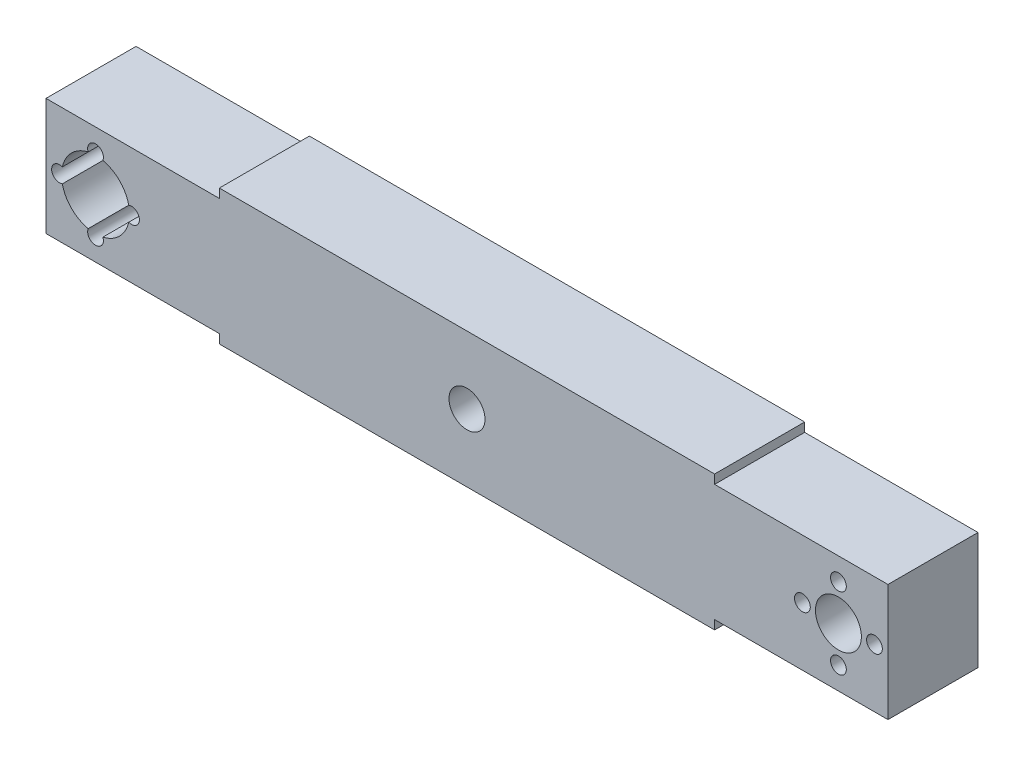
from build123d import *

# Parameters (mm, degrees)
CROQUIS1_W              = 110
CROQUIS1_H              = 30
SALIENTE_EXTRUIR1_DEPTH = 20
CROQUIS3_W              = 189
CROQUIS3_H              = 28
SALIENTE_EXTRUIR3_DEPTH = 20
CROQUIS4_R              = 5.1
CROQUIS4_R_2            = 1.75
CORTAR_EXTRUIR1_DEPTH   = 20
CUT_EXTRUDE1_REACH      = 99.751
CUT_EXTRUDE2_REACH      = 98.785
SKETCH2_R               = 4
CUT_EXTRUDE3_REACH      = 98.785
SKETCH6_R               = 3
CUT_EXTRUDE4_REACH      = 101.164
SKETCH7_R               = 7.55


with BuildPart() as part:
    # Croquis1 → Saliente-Extruir1 (new body)
    with BuildSketch(Plane.XY):
        Rectangle(CROQUIS1_W, CROQUIS1_H)
    extrude(amount=SALIENTE_EXTRUIR1_DEPTH)

    # Croquis3 → Saliente-Extruir3 (add)
    with BuildSketch(Plane(origin=(0, 0, 0), x_dir=(-1, 0, 0), z_dir=(0, 0, -1))):
        Rectangle(CROQUIS3_W, CROQUIS3_H)
    extrude(amount=-SALIENTE_EXTRUIR3_DEPTH)

    # Croquis4 → Cortar-Extruir1 (cut)
    with BuildSketch(Plane(origin=(0, 0, 0), x_dir=(-1, 0, 0), z_dir=(0, 0, -1))):
        with Locations((-82.5, 0)):
            Circle(CROQUIS4_R)
        with Locations((-90.5, 0)):
            Circle(CROQUIS4_R_2)
        with Locations((-82.5, 8)):
            Circle(CROQUIS4_R_2)
        with Locations((-74.5, 0)):
            Circle(CROQUIS4_R_2)
        with Locations((-82.5, -8)):
            Circle(CROQUIS4_R_2)
        with Locations(Location((82.5, -8, 0), (0, 0, 180))):
            Circle(CROQUIS4_R_2)
        with Locations(Location((74.5, 0, 0), (0, 0, 180))):
            Circle(CROQUIS4_R_2)
        with Locations(Location((90.5, 0, 0), (0, 0, 180))):
            Circle(CROQUIS4_R_2)
        with Locations(Location((82.5, 8, 0), (0, 0, 180))):
            Circle(CROQUIS4_R_2)
        with Locations(Location((82.5, 0, 0), (0, 0, 180))):
            Circle(CROQUIS4_R)
    extrude(amount=-CORTAR_EXTRUIR1_DEPTH, mode=Mode.SUBTRACT)

    # Sketch1 → Cut-Extrude1 (cut, up to next)
    with BuildSketch(Plane(origin=(0, 0, 0), x_dir=(-1, 0, 0), z_dir=(0, 0, -1)), mode=Mode.PRIVATE) as cut_extrude1_sk1:
        Polygon((-56, 13), (-93.5, 13), (-93.5, -13), (-56, -13), (-55, -13), (-55, -14), (-94.5, -14), (-94.5, 14), (-55, 14), (-55, 13), align=None)
    cut_extrude1_tool1 = extrude(cut_extrude1_sk1.sketch, amount=-CUT_EXTRUDE1_REACH, mode=Mode.PRIVATE) & part.part
    # Sketch1 → Cut-Extrude1 (cut, up to next)
    with BuildSketch(Plane(origin=(0, 0, 0), x_dir=(-1, 0, 0), z_dir=(0, 0, -1)), mode=Mode.PRIVATE) as cut_extrude1_sk2:
        Polygon((55, -13), (55, -14), (94.5, -14), (94.5, 14), (55, 14), (55, 13), (56, 13), (93.5, 13), (93.5, -13), (56, -13), align=None)
    cut_extrude1_tool2 = extrude(cut_extrude1_sk2.sketch, amount=-CUT_EXTRUDE1_REACH, mode=Mode.PRIVATE) & part.part
    add(cut_extrude1_tool1.solids().sort_by_distance((74.75, 13.484175, 0))[0], mode=Mode.SUBTRACT)
    add(cut_extrude1_tool2.solids().sort_by_distance((-55.484175, -13.5, 0))[0], mode=Mode.SUBTRACT)

    # Sketch2 → Cut-Extrude2 (cut, up to next)
    with BuildSketch(Plane(origin=(0, 0, 0), x_dir=(-1, 0, 0), z_dir=(0, 0, -1)), mode=Mode.PRIVATE) as cut_extrude2_sk1:
        Circle(SKETCH2_R)
    cut_extrude2_tool1 = extrude(cut_extrude2_sk1.sketch, amount=-CUT_EXTRUDE2_REACH, mode=Mode.PRIVATE) & part.part
    add(cut_extrude2_tool1.solids().sort_by_distance((0, 0, 0))[0], mode=Mode.SUBTRACT)

    # Sketch5 → Revolve1 (revolve)
    with BuildSketch(Plane(origin=(0, 0, 0), x_dir=(1, 0, 0), z_dir=(0, 1, 0))):
        Polygon((0, 0), (0, 12.889775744), (11.185362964, 0), align=None)
    revolve(axis=Axis((0, 0, 0), (0, 0, -1)))

    # Cut-Extrude3: up to this cone (the profile starts inside it)
    cut_extrude3_end = Plane(origin=(0, 0, 0), z_dir=(0, 0, 1)).offset(-12.889774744) * Cone(1e-06, 107.048249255, 123.360137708, align=(Align.CENTER, Align.CENTER, Align.MIN), mode=Mode.PRIVATE)
    # Sketch6 → Cut-Extrude3 (cut, up to the surface)
    with BuildSketch(Plane.XY, mode=Mode.PRIVATE) as cut_extrude3_sk1:
        Circle(SKETCH6_R)
    cut_extrude3_tool1 = extrude(cut_extrude3_sk1.sketch, amount=-CUT_EXTRUDE3_REACH, mode=Mode.PRIVATE) & cut_extrude3_end
    add(cut_extrude3_tool1.solids().sort_by_distance((0, 0, 0))[0], mode=Mode.SUBTRACT)


with BuildPart() as cut_extrude3_kept_piece:
    # of the separate pieces the step leaves, the one the design keeps (cut_extrude3_pieces_kept)
    add(part.part.solids().sort_by_distance((-55, -15, 0))[0])

    # Sketch7 → Cut-Extrude4 (cut, up to next)
    with BuildSketch(Plane.XY.offset(20), mode=Mode.PRIVATE) as cut_extrude4_sk1:
        with Locations((-82.5, 0)):
            Circle(SKETCH7_R)
    cut_extrude4_tool1 = extrude(cut_extrude4_sk1.sketch, amount=-CUT_EXTRUDE4_REACH, mode=Mode.PRIVATE) & cut_extrude3_kept_piece.part
    add(cut_extrude4_tool1.solids().sort_by_distance((-82.5, 0, 20))[0], mode=Mode.SUBTRACT)


solid = cut_extrude3_kept_piece.part
